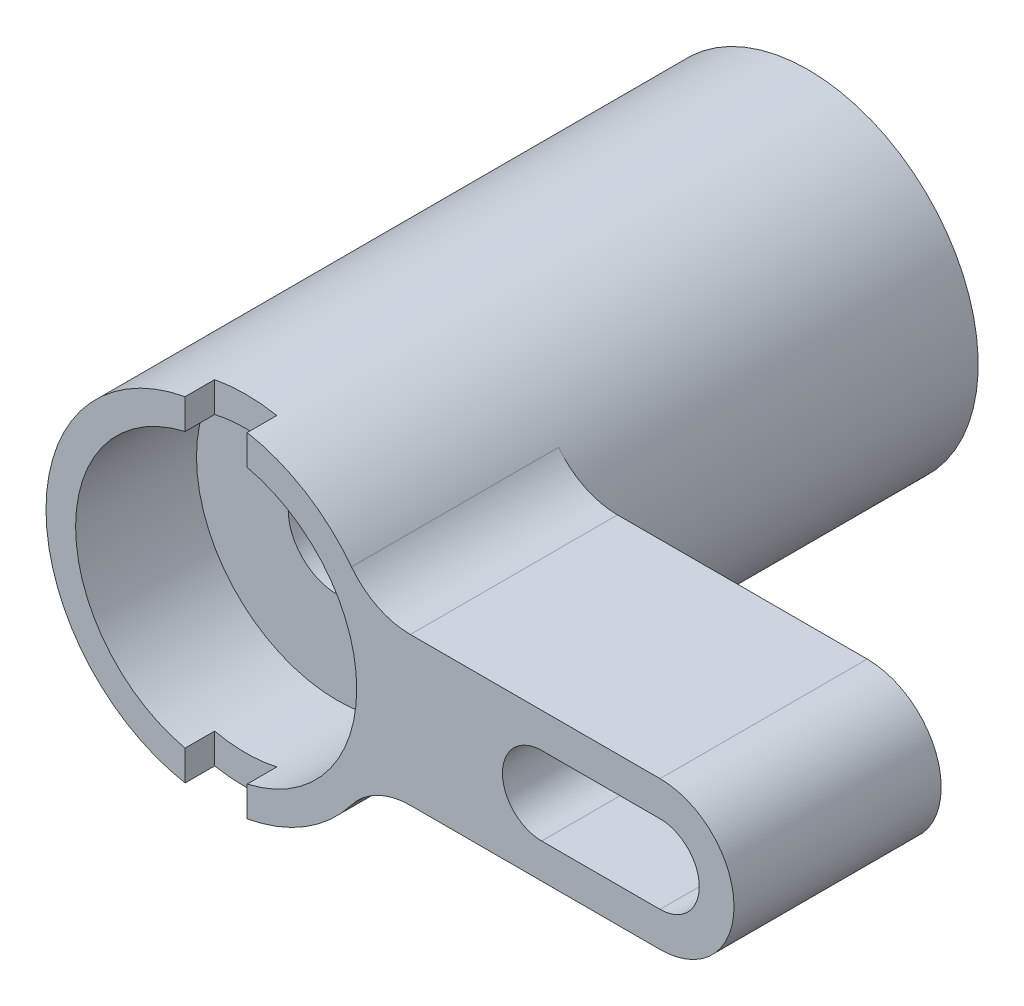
ISO-10303-21;
HEADER;
FILE_DESCRIPTION(('STEP AP214'),'2;1');
FILE_NAME('part.step','',(''),(''),'','','');
FILE_SCHEMA(('AUTOMOTIVE_DESIGN { 1 0 10303 214 1 1 1 1 }'));
ENDSEC;
DATA;
#1=APPLICATION_CONTEXT('core data for automotive mechanical design processes');
#2=APPLICATION_PROTOCOL_DEFINITION('international standard','automotive_design',2000,#1);
#3=PRODUCT_CONTEXT('',#1,'mechanical');
#4=PRODUCT('Part','Part','',(#3));
#5=PRODUCT_RELATED_PRODUCT_CATEGORY('part','',(#4));
#6=PRODUCT_DEFINITION_FORMATION('','',#4);
#7=PRODUCT_DEFINITION_CONTEXT('part definition',#1,'design');
#8=PRODUCT_DEFINITION('design','',#6,#7);
#9=PRODUCT_DEFINITION_SHAPE('','',#8);
#10=(LENGTH_UNIT() NAMED_UNIT(*) SI_UNIT(.MILLI.,.METRE.));
#11=(NAMED_UNIT(*) PLANE_ANGLE_UNIT() SI_UNIT($,.RADIAN.));
#12=(NAMED_UNIT(*) SI_UNIT($,.STERADIAN.) SOLID_ANGLE_UNIT());
#13=UNCERTAINTY_MEASURE_WITH_UNIT(LENGTH_MEASURE(1.E-05),#10,'distance_accuracy_value','');
#14=(GEOMETRIC_REPRESENTATION_CONTEXT(3) GLOBAL_UNCERTAINTY_ASSIGNED_CONTEXT((#13)) GLOBAL_UNIT_ASSIGNED_CONTEXT((#10,
#11,#12)) REPRESENTATION_CONTEXT('',''));
#15=CARTESIAN_POINT('',(0.,0.,0.));
#16=DIRECTION('',(0.,0.,1.));
#17=DIRECTION('',(1.,0.,0.));
#18=AXIS2_PLACEMENT_3D('',#15,#16,#17);
#19=CARTESIAN_POINT('',(0.,0.,26.));
#20=DIRECTION('',(0.,0.,-1.));
#21=DIRECTION('',(0.,-1.,0.));
#22=AXIS2_PLACEMENT_3D('',#19,#20,#21);
#23=PLANE('',#22);
#24=CARTESIAN_POINT('',(0.,0.,26.));
#25=DIRECTION('',(0.,0.,1.));
#26=DIRECTION('',(0.,1.,0.));
#27=AXIS2_PLACEMENT_3D('',#24,#25,#26);
#28=CIRCLE('',#27,3.3);
#29=CARTESIAN_POINT('',(0.,3.3,26.));
#30=VERTEX_POINT('',#29);
#31=EDGE_CURVE('E217',#30,#30,#28,.T.);
#32=ORIENTED_EDGE('',*,*,#31,.T.);
#33=EDGE_LOOP('',(#32));
#34=FACE_BOUND('',#33,.T.);
#35=CARTESIAN_POINT('',(0.,0.,26.));
#36=DIRECTION('',(0.,0.,-1.));
#37=DIRECTION('',(0.,-1.,0.));
#38=AXIS2_PLACEMENT_3D('',#35,#36,#37);
#39=CIRCLE('',#38,3.);
#40=CARTESIAN_POINT('',(0.,-3.,26.));
#41=VERTEX_POINT('',#40);
#42=EDGE_CURVE('E324',#41,#41,#39,.F.);
#43=ORIENTED_EDGE('',*,*,#42,.F.);
#44=EDGE_LOOP('',(#43));
#45=FACE_BOUND('',#44,.T.);
#46=ADVANCED_FACE('F14',(#34,#45),#23,.F.);
#47=CARTESIAN_POINT('',(0.,0.,0.));
#48=DIRECTION('',(0.,0.,1.));
#49=DIRECTION('',(0.,1.,0.));
#50=AXIS2_PLACEMENT_3D('',#47,#48,#49);
#51=PLANE('',#50);
#52=CARTESIAN_POINT('',(0.,0.,0.));
#53=DIRECTION('',(0.,0.,1.));
#54=DIRECTION('',(0.,1.,0.));
#55=AXIS2_PLACEMENT_3D('',#52,#53,#54);
#56=CIRCLE('',#55,8.);
#57=CARTESIAN_POINT('',(0.,8.,0.));
#58=VERTEX_POINT('',#57);
#59=EDGE_CURVE('E18',#58,#58,#56,.T.);
#60=ORIENTED_EDGE('',*,*,#59,.T.);
#61=EDGE_LOOP('',(#60));
#62=FACE_BOUND('',#61,.T.);
#63=CARTESIAN_POINT('',(0.,0.,0.));
#64=DIRECTION('',(0.,0.,1.));
#65=DIRECTION('',(0.,1.,0.));
#66=AXIS2_PLACEMENT_3D('',#63,#64,#65);
#67=CIRCLE('',#66,11.5);
#68=CARTESIAN_POINT('',(0.,11.5,0.));
#69=VERTEX_POINT('',#68);
#70=EDGE_CURVE('E207',#69,#69,#67,.T.);
#71=ORIENTED_EDGE('',*,*,#70,.F.);
#72=EDGE_LOOP('',(#71));
#73=FACE_BOUND('',#72,.T.);
#74=ADVANCED_FACE('F351',(#62,#73),#51,.F.);
#75=CARTESIAN_POINT('',(0.,0.,40.));
#76=DIRECTION('',(0.,0.,1.));
#77=DIRECTION('',(0.,1.,0.));
#78=AXIS2_PLACEMENT_3D('',#75,#76,#77);
#79=PLANE('',#78);
#80=CARTESIAN_POINT('',(0.,0.,40.));
#81=DIRECTION('',(0.,0.,1.));
#82=DIRECTION('',(0.,1.,0.));
#83=AXIS2_PLACEMENT_3D('',#80,#81,#82);
#84=CIRCLE('',#83,9.5);
#85=CARTESIAN_POINT('',(2.1,-9.26498785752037,40.));
#86=VERTEX_POINT('',#85);
#87=CARTESIAN_POINT('',(2.1,9.26498785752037,40.));
#88=VERTEX_POINT('',#87);
#89=EDGE_CURVE('E159',#86,#88,#84,.T.);
#90=ORIENTED_EDGE('',*,*,#89,.F.);
#91=DIRECTION('',(0.,1.,0.));
#92=VECTOR('',#91,1.);
#93=CARTESIAN_POINT('',(2.1,-12.,40.));
#94=LINE('',#93,#92);
#95=CARTESIAN_POINT('',(2.1,-11.3066352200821,40.));
#96=VERTEX_POINT('',#95);
#97=EDGE_CURVE('E168',#96,#86,#94,.T.);
#98=ORIENTED_EDGE('',*,*,#97,.F.);
#99=CARTESIAN_POINT('',(0.,0.,40.));
#100=DIRECTION('',(0.,0.,1.));
#101=DIRECTION('',(0.,1.,0.));
#102=AXIS2_PLACEMENT_3D('',#99,#100,#101);
#103=CIRCLE('',#102,11.5);
#104=CARTESIAN_POINT('',(9.14731240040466,-6.96969696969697,40.));
#105=VERTEX_POINT('',#104);
#106=EDGE_CURVE('E269',#96,#105,#103,.T.);
#107=ORIENTED_EDGE('',*,*,#106,.T.);
#108=CARTESIAN_POINT('',(13.1244047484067,-10.,40.));
#109=DIRECTION('',(0.,0.,1.));
#110=DIRECTION('',(0.,1.,0.));
#111=AXIS2_PLACEMENT_3D('',#108,#109,#110);
#112=CIRCLE('',#111,5.);
#113=CARTESIAN_POINT('',(13.1244047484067,-5.,40.));
#114=VERTEX_POINT('',#113);
#115=EDGE_CURVE('E242',#105,#114,#112,.F.);
#116=ORIENTED_EDGE('',*,*,#115,.T.);
#117=DIRECTION('',(1.,0.,0.));
#118=VECTOR('',#117,1.);
#119=CARTESIAN_POINT('',(30.,-5.,40.));
#120=LINE('',#119,#118);
#121=CARTESIAN_POINT('',(30.,-5.,40.));
#122=VERTEX_POINT('',#121);
#123=EDGE_CURVE('E282',#114,#122,#120,.T.);
#124=ORIENTED_EDGE('',*,*,#123,.T.);
#125=CARTESIAN_POINT('',(30.,0.,40.));
#126=DIRECTION('',(0.,0.,1.));
#127=DIRECTION('',(0.,1.,0.));
#128=AXIS2_PLACEMENT_3D('',#125,#126,#127);
#129=CIRCLE('',#128,5.);
#130=CARTESIAN_POINT('',(30.,5.,40.));
#131=VERTEX_POINT('',#130);
#132=EDGE_CURVE('E227',#122,#131,#129,.T.);
#133=ORIENTED_EDGE('',*,*,#132,.T.);
#134=DIRECTION('',(-1.,0.,0.));
#135=VECTOR('',#134,1.);
#136=CARTESIAN_POINT('',(30.,5.,40.));
#137=LINE('',#136,#135);
#138=CARTESIAN_POINT('',(13.1244047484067,5.,40.));
#139=VERTEX_POINT('',#138);
#140=EDGE_CURVE('E277',#131,#139,#137,.T.);
#141=ORIENTED_EDGE('',*,*,#140,.T.);
#142=CARTESIAN_POINT('',(13.1244047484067,10.,40.));
#143=DIRECTION('',(0.,0.,1.));
#144=DIRECTION('',(0.,1.,0.));
#145=AXIS2_PLACEMENT_3D('',#142,#143,#144);
#146=CIRCLE('',#145,5.);
#147=CARTESIAN_POINT('',(9.14731240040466,6.96969696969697,40.));
#148=VERTEX_POINT('',#147);
#149=EDGE_CURVE('E23',#139,#148,#146,.F.);
#150=ORIENTED_EDGE('',*,*,#149,.T.);
#151=CARTESIAN_POINT('',(2.1,11.3066352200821,40.));
#152=VERTEX_POINT('',#151);
#153=EDGE_CURVE('E279',#148,#152,#103,.T.);
#154=ORIENTED_EDGE('',*,*,#153,.T.);
#155=EDGE_CURVE('E170',#88,#152,#94,.T.);
#156=ORIENTED_EDGE('',*,*,#155,.F.);
#157=EDGE_LOOP('',(#90,#98,#107,#116,#124,#133,#141,#150,#154,#156));
#158=FACE_BOUND('',#157,.T.);
#159=CARTESIAN_POINT('',(30.,0.,40.));
#160=DIRECTION('',(0.,0.,1.));
#161=DIRECTION('',(0.,1.,0.));
#162=AXIS2_PLACEMENT_3D('',#159,#160,#161);
#163=CIRCLE('',#162,2.65);
#164=CARTESIAN_POINT('',(30.,-2.65,40.));
#165=VERTEX_POINT('',#164);
#166=CARTESIAN_POINT('',(30.,2.65,40.));
#167=VERTEX_POINT('',#166);
#168=EDGE_CURVE('E183',#165,#167,#163,.T.);
#169=ORIENTED_EDGE('',*,*,#168,.F.);
#170=DIRECTION('',(1.,0.,0.));
#171=VECTOR('',#170,1.);
#172=CARTESIAN_POINT('',(30.,-2.65,40.));
#173=LINE('',#172,#171);
#174=CARTESIAN_POINT('',(22.,-2.65,40.));
#175=VERTEX_POINT('',#174);
#176=EDGE_CURVE('E191',#175,#165,#173,.T.);
#177=ORIENTED_EDGE('',*,*,#176,.F.);
#178=CARTESIAN_POINT('',(22.,0.,40.));
#179=DIRECTION('',(0.,0.,1.));
#180=DIRECTION('',(0.,1.,0.));
#181=AXIS2_PLACEMENT_3D('',#178,#179,#180);
#182=CIRCLE('',#181,2.65);
#183=CARTESIAN_POINT('',(22.,2.65,40.));
#184=VERTEX_POINT('',#183);
#185=EDGE_CURVE('E188',#184,#175,#182,.T.);
#186=ORIENTED_EDGE('',*,*,#185,.F.);
#187=DIRECTION('',(-1.,0.,0.));
#188=VECTOR('',#187,1.);
#189=CARTESIAN_POINT('',(30.,2.65,40.));
#190=LINE('',#189,#188);
#191=EDGE_CURVE('E185',#167,#184,#190,.T.);
#192=ORIENTED_EDGE('',*,*,#191,.F.);
#193=EDGE_LOOP('',(#169,#177,#186,#192));
#194=FACE_BOUND('',#193,.T.);
#195=ADVANCED_FACE('F267',(#158,#194),#79,.T.);
#196=CARTESIAN_POINT('',(-2.1,9.26498785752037,40.));
#197=VERTEX_POINT('',#196);
#198=CARTESIAN_POINT('',(-2.1,-9.26498785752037,40.));
#199=VERTEX_POINT('',#198);
#200=EDGE_CURVE('E142',#197,#199,#84,.T.);
#201=ORIENTED_EDGE('',*,*,#200,.F.);
#202=DIRECTION('',(0.,-1.,0.));
#203=VECTOR('',#202,1.);
#204=CARTESIAN_POINT('',(-2.1,-12.,40.));
#205=LINE('',#204,#203);
#206=CARTESIAN_POINT('',(-2.1,11.3066352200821,40.));
#207=VERTEX_POINT('',#206);
#208=EDGE_CURVE('E155',#207,#197,#205,.T.);
#209=ORIENTED_EDGE('',*,*,#208,.F.);
#210=CARTESIAN_POINT('',(-2.1,-11.3066352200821,40.));
#211=VERTEX_POINT('',#210);
#212=EDGE_CURVE('E276',#207,#211,#103,.T.);
#213=ORIENTED_EDGE('',*,*,#212,.T.);
#214=EDGE_CURVE('E157',#199,#211,#205,.T.);
#215=ORIENTED_EDGE('',*,*,#214,.F.);
#216=EDGE_LOOP('',(#201,#209,#213,#215));
#217=FACE_BOUND('',#216,.T.);
#218=ADVANCED_FACE('F16',(#217),#79,.T.);
#219=CARTESIAN_POINT('',(0.,0.,26.));
#220=DIRECTION('',(0.,0.,1.));
#221=DIRECTION('',(0.,1.,0.));
#222=AXIS2_PLACEMENT_3D('',#219,#220,#221);
#223=PLANE('',#222);
#224=DIRECTION('',(-1.,0.,0.));
#225=VECTOR('',#224,1.);
#226=CARTESIAN_POINT('',(30.,-2.65,26.));
#227=LINE('',#226,#225);
#228=CARTESIAN_POINT('',(30.,-2.65,26.));
#229=VERTEX_POINT('',#228);
#230=CARTESIAN_POINT('',(22.,-2.65,26.));
#231=VERTEX_POINT('',#230);
#232=EDGE_CURVE('E177',#229,#231,#227,.T.);
#233=ORIENTED_EDGE('',*,*,#232,.F.);
#234=CARTESIAN_POINT('',(30.,0.,26.));
#235=DIRECTION('',(0.,0.,1.));
#236=DIRECTION('',(0.,1.,0.));
#237=AXIS2_PLACEMENT_3D('',#234,#235,#236);
#238=CIRCLE('',#237,2.65);
#239=CARTESIAN_POINT('',(30.,2.65,26.));
#240=VERTEX_POINT('',#239);
#241=EDGE_CURVE('E180',#240,#229,#238,.F.);
#242=ORIENTED_EDGE('',*,*,#241,.F.);
#243=DIRECTION('',(1.,0.,0.));
#244=VECTOR('',#243,1.);
#245=CARTESIAN_POINT('',(30.,2.65,26.));
#246=LINE('',#245,#244);
#247=CARTESIAN_POINT('',(22.,2.65,26.));
#248=VERTEX_POINT('',#247);
#249=EDGE_CURVE('E197',#248,#240,#246,.T.);
#250=ORIENTED_EDGE('',*,*,#249,.F.);
#251=CARTESIAN_POINT('',(22.,0.,26.));
#252=DIRECTION('',(0.,0.,1.));
#253=DIRECTION('',(0.,1.,0.));
#254=AXIS2_PLACEMENT_3D('',#251,#252,#253);
#255=CIRCLE('',#254,2.65);
#256=EDGE_CURVE('E175',#231,#248,#255,.F.);
#257=ORIENTED_EDGE('',*,*,#256,.F.);
#258=EDGE_LOOP('',(#233,#242,#250,#257));
#259=FACE_BOUND('',#258,.T.);
#260=DIRECTION('',(1.,0.,0.));
#261=VECTOR('',#260,1.);
#262=CARTESIAN_POINT('',(30.,-5.,26.));
#263=LINE('',#262,#261);
#264=CARTESIAN_POINT('',(13.1244047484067,-5.,26.));
#265=VERTEX_POINT('',#264);
#266=CARTESIAN_POINT('',(30.,-5.,26.));
#267=VERTEX_POINT('',#266);
#268=EDGE_CURVE('E224',#265,#267,#263,.T.);
#269=ORIENTED_EDGE('',*,*,#268,.F.);
#270=CARTESIAN_POINT('',(13.1244047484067,-10.,26.));
#271=DIRECTION('',(0.,0.,1.));
#272=DIRECTION('',(0.,1.,0.));
#273=AXIS2_PLACEMENT_3D('',#270,#271,#272);
#274=CIRCLE('',#273,5.);
#275=CARTESIAN_POINT('',(9.14731240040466,-6.96969696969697,26.));
#276=VERTEX_POINT('',#275);
#277=EDGE_CURVE('E239',#265,#276,#274,.T.);
#278=ORIENTED_EDGE('',*,*,#277,.T.);
#279=CARTESIAN_POINT('',(0.,0.,26.));
#280=DIRECTION('',(0.,0.,1.));
#281=DIRECTION('',(0.,1.,0.));
#282=AXIS2_PLACEMENT_3D('',#279,#280,#281);
#283=CIRCLE('',#282,11.5);
#284=CARTESIAN_POINT('',(9.14731240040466,6.96969696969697,26.));
#285=VERTEX_POINT('',#284);
#286=EDGE_CURVE('E206',#276,#285,#283,.T.);
#287=ORIENTED_EDGE('',*,*,#286,.T.);
#288=CARTESIAN_POINT('',(13.1244047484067,10.,26.));
#289=DIRECTION('',(0.,0.,1.));
#290=DIRECTION('',(0.,1.,0.));
#291=AXIS2_PLACEMENT_3D('',#288,#289,#290);
#292=CIRCLE('',#291,5.);
#293=CARTESIAN_POINT('',(13.1244047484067,5.,26.));
#294=VERTEX_POINT('',#293);
#295=EDGE_CURVE('E244',#285,#294,#292,.T.);
#296=ORIENTED_EDGE('',*,*,#295,.T.);
#297=DIRECTION('',(-1.,0.,0.));
#298=VECTOR('',#297,1.);
#299=CARTESIAN_POINT('',(30.,5.,26.));
#300=LINE('',#299,#298);
#301=CARTESIAN_POINT('',(30.,5.,26.));
#302=VERTEX_POINT('',#301);
#303=EDGE_CURVE('E221',#302,#294,#300,.T.);
#304=ORIENTED_EDGE('',*,*,#303,.F.);
#305=CARTESIAN_POINT('',(30.,0.,26.));
#306=DIRECTION('',(0.,0.,1.));
#307=DIRECTION('',(0.,1.,0.));
#308=AXIS2_PLACEMENT_3D('',#305,#306,#307);
#309=CIRCLE('',#308,5.);
#310=EDGE_CURVE('E210',#267,#302,#309,.T.);
#311=ORIENTED_EDGE('',*,*,#310,.F.);
#312=EDGE_LOOP('',(#269,#278,#287,#296,#304,#311));
#313=FACE_BOUND('',#312,.T.);
#314=ADVANCED_FACE('F376',(#259,#313),#223,.F.);
#315=CARTESIAN_POINT('',(30.,0.,40.));
#316=DIRECTION('',(0.,0.,-1.));
#317=DIRECTION('',(0.,-1.,0.));
#318=AXIS2_PLACEMENT_3D('',#315,#316,#317);
#319=CYLINDRICAL_SURFACE('',#318,5.);
#320=ORIENTED_EDGE('',*,*,#310,.T.);
#321=DIRECTION('',(0.,0.,-1.));
#322=VECTOR('',#321,1.);
#323=CARTESIAN_POINT('',(30.,5.,40.));
#324=LINE('',#323,#322);
#325=EDGE_CURVE('E290',#131,#302,#324,.T.);
#326=ORIENTED_EDGE('',*,*,#325,.F.);
#327=ORIENTED_EDGE('',*,*,#132,.F.);
#328=DIRECTION('',(0.,0.,-1.));
#329=VECTOR('',#328,1.);
#330=CARTESIAN_POINT('',(30.,-5.,40.));
#331=LINE('',#330,#329);
#332=EDGE_CURVE('E285',#122,#267,#331,.T.);
#333=ORIENTED_EDGE('',*,*,#332,.T.);
#334=EDGE_LOOP('',(#320,#326,#327,#333));
#335=FACE_BOUND('',#334,.T.);
#336=ADVANCED_FACE('F373',(#335),#319,.T.);
#337=CARTESIAN_POINT('',(30.,5.,40.));
#338=DIRECTION('',(0.,-1.,0.));
#339=DIRECTION('',(1.,0.,0.));
#340=AXIS2_PLACEMENT_3D('',#337,#338,#339);
#341=PLANE('',#340);
#342=ORIENTED_EDGE('',*,*,#303,.T.);
#343=DIRECTION('',(0.,0.,1.));
#344=VECTOR('',#343,1.);
#345=CARTESIAN_POINT('',(13.1244047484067,5.,40.));
#346=LINE('',#345,#344);
#347=EDGE_CURVE('E38',#294,#139,#346,.T.);
#348=ORIENTED_EDGE('',*,*,#347,.T.);
#349=ORIENTED_EDGE('',*,*,#140,.F.);
#350=ORIENTED_EDGE('',*,*,#325,.T.);
#351=EDGE_LOOP('',(#342,#348,#349,#350));
#352=FACE_BOUND('',#351,.T.);
#353=ADVANCED_FACE('F370',(#352),#341,.F.);
#354=CARTESIAN_POINT('',(0.,0.,40.));
#355=DIRECTION('',(0.,0.,-1.));
#356=DIRECTION('',(0.,-1.,0.));
#357=AXIS2_PLACEMENT_3D('',#354,#355,#356);
#358=CYLINDRICAL_SURFACE('',#357,11.5);
#359=ORIENTED_EDGE('',*,*,#286,.F.);
#360=DIRECTION('',(0.,0.,-1.));
#361=VECTOR('',#360,1.);
#362=CARTESIAN_POINT('',(9.14731240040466,-6.96969696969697,40.));
#363=LINE('',#362,#361);
#364=EDGE_CURVE('E236',#276,#105,#363,.F.);
#365=ORIENTED_EDGE('',*,*,#364,.T.);
#366=ORIENTED_EDGE('',*,*,#106,.F.);
#367=DIRECTION('',(0.,0.,-1.));
#368=VECTOR('',#367,1.);
#369=CARTESIAN_POINT('',(2.1,-11.3066352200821,40.));
#370=LINE('',#369,#368);
#371=CARTESIAN_POINT('',(2.1,-11.3066352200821,38.));
#372=VERTEX_POINT('',#371);
#373=EDGE_CURVE('E228',#96,#372,#370,.T.);
#374=ORIENTED_EDGE('',*,*,#373,.T.);
#375=CARTESIAN_POINT('',(0.,0.,38.));
#376=DIRECTION('',(0.,0.,1.));
#377=DIRECTION('',(0.,1.,0.));
#378=AXIS2_PLACEMENT_3D('',#375,#376,#377);
#379=CIRCLE('',#378,11.5);
#380=CARTESIAN_POINT('',(-2.1,-11.3066352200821,38.));
#381=VERTEX_POINT('',#380);
#382=EDGE_CURVE('E300',#381,#372,#379,.T.);
#383=ORIENTED_EDGE('',*,*,#382,.F.);
#384=DIRECTION('',(0.,0.,-1.));
#385=VECTOR('',#384,1.);
#386=CARTESIAN_POINT('',(-2.1,-11.3066352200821,40.));
#387=LINE('',#386,#385);
#388=EDGE_CURVE('E305',#381,#211,#387,.F.);
#389=ORIENTED_EDGE('',*,*,#388,.T.);
#390=ORIENTED_EDGE('',*,*,#212,.F.);
#391=DIRECTION('',(0.,0.,-1.));
#392=VECTOR('',#391,1.);
#393=CARTESIAN_POINT('',(-2.1,11.3066352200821,40.));
#394=LINE('',#393,#392);
#395=CARTESIAN_POINT('',(-2.1,11.3066352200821,38.));
#396=VERTEX_POINT('',#395);
#397=EDGE_CURVE('E163',#207,#396,#394,.T.);
#398=ORIENTED_EDGE('',*,*,#397,.T.);
#399=CARTESIAN_POINT('',(2.1,11.3066352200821,38.));
#400=VERTEX_POINT('',#399);
#401=EDGE_CURVE('E296',#400,#396,#379,.T.);
#402=ORIENTED_EDGE('',*,*,#401,.F.);
#403=DIRECTION('',(0.,0.,-1.));
#404=VECTOR('',#403,1.);
#405=CARTESIAN_POINT('',(2.1,11.3066352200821,40.));
#406=LINE('',#405,#404);
#407=EDGE_CURVE('E303',#400,#152,#406,.F.);
#408=ORIENTED_EDGE('',*,*,#407,.T.);
#409=ORIENTED_EDGE('',*,*,#153,.F.);
#410=DIRECTION('',(0.,0.,-1.));
#411=VECTOR('',#410,1.);
#412=CARTESIAN_POINT('',(9.14731240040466,6.96969696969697,40.));
#413=LINE('',#412,#411);
#414=EDGE_CURVE('E233',#148,#285,#413,.T.);
#415=ORIENTED_EDGE('',*,*,#414,.T.);
#416=EDGE_LOOP('',(#359,#365,#366,#374,#383,#389,#390,#398,#402,#408,#409,#415));
#417=FACE_BOUND('',#416,.T.);
#418=ORIENTED_EDGE('',*,*,#70,.T.);
#419=EDGE_LOOP('',(#418));
#420=FACE_BOUND('',#419,.T.);
#421=ADVANCED_FACE('F272',(#417,#420),#358,.T.);
#422=CARTESIAN_POINT('',(30.,-5.,40.));
#423=DIRECTION('',(0.,1.,0.));
#424=DIRECTION('',(-1.,0.,0.));
#425=AXIS2_PLACEMENT_3D('',#422,#423,#424);
#426=PLANE('',#425);
#427=ORIENTED_EDGE('',*,*,#123,.F.);
#428=DIRECTION('',(0.,0.,1.));
#429=VECTOR('',#428,1.);
#430=CARTESIAN_POINT('',(13.1244047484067,-5.,26.));
#431=LINE('',#430,#429);
#432=EDGE_CURVE('E230',#114,#265,#431,.F.);
#433=ORIENTED_EDGE('',*,*,#432,.T.);
#434=ORIENTED_EDGE('',*,*,#268,.T.);
#435=ORIENTED_EDGE('',*,*,#332,.F.);
#436=EDGE_LOOP('',(#427,#433,#434,#435));
#437=FACE_BOUND('',#436,.T.);
#438=ADVANCED_FACE('F364',(#437),#426,.F.);
#439=CARTESIAN_POINT('',(30.,0.,-0.001000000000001));
#440=DIRECTION('',(0.,0.,1.));
#441=DIRECTION('',(0.,1.,0.));
#442=AXIS2_PLACEMENT_3D('',#439,#440,#441);
#443=CYLINDRICAL_SURFACE('',#442,2.65);
#444=ORIENTED_EDGE('',*,*,#241,.T.);
#445=DIRECTION('',(0.,0.,1.));
#446=VECTOR('',#445,1.);
#447=CARTESIAN_POINT('',(30.,-2.65,-0.001000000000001));
#448=LINE('',#447,#446);
#449=EDGE_CURVE('E195',#229,#165,#448,.T.);
#450=ORIENTED_EDGE('',*,*,#449,.T.);
#451=ORIENTED_EDGE('',*,*,#168,.T.);
#452=DIRECTION('',(0.,0.,1.));
#453=VECTOR('',#452,1.);
#454=CARTESIAN_POINT('',(30.,2.65,-0.001000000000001));
#455=LINE('',#454,#453);
#456=EDGE_CURVE('E194',#240,#167,#455,.T.);
#457=ORIENTED_EDGE('',*,*,#456,.F.);
#458=EDGE_LOOP('',(#444,#450,#451,#457));
#459=FACE_BOUND('',#458,.T.);
#460=ADVANCED_FACE('F361',(#459),#443,.F.);
#461=CARTESIAN_POINT('',(30.,-2.65,-0.001000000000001));
#462=DIRECTION('',(0.,-1.,0.));
#463=DIRECTION('',(1.,0.,0.));
#464=AXIS2_PLACEMENT_3D('',#461,#462,#463);
#465=PLANE('',#464);
#466=ORIENTED_EDGE('',*,*,#232,.T.);
#467=DIRECTION('',(0.,0.,1.));
#468=VECTOR('',#467,1.);
#469=CARTESIAN_POINT('',(22.,-2.65,-0.001000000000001));
#470=LINE('',#469,#468);
#471=EDGE_CURVE('E198',#231,#175,#470,.T.);
#472=ORIENTED_EDGE('',*,*,#471,.T.);
#473=ORIENTED_EDGE('',*,*,#176,.T.);
#474=ORIENTED_EDGE('',*,*,#449,.F.);
#475=EDGE_LOOP('',(#466,#472,#473,#474));
#476=FACE_BOUND('',#475,.T.);
#477=ADVANCED_FACE('F420',(#476),#465,.F.);
#478=CARTESIAN_POINT('',(22.,0.,-0.001000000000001));
#479=DIRECTION('',(0.,0.,1.));
#480=DIRECTION('',(0.,1.,0.));
#481=AXIS2_PLACEMENT_3D('',#478,#479,#480);
#482=CYLINDRICAL_SURFACE('',#481,2.65);
#483=ORIENTED_EDGE('',*,*,#256,.T.);
#484=DIRECTION('',(0.,0.,1.));
#485=VECTOR('',#484,1.);
#486=CARTESIAN_POINT('',(22.,2.65,-0.001000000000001));
#487=LINE('',#486,#485);
#488=EDGE_CURVE('E200',#248,#184,#487,.T.);
#489=ORIENTED_EDGE('',*,*,#488,.T.);
#490=ORIENTED_EDGE('',*,*,#185,.T.);
#491=ORIENTED_EDGE('',*,*,#471,.F.);
#492=EDGE_LOOP('',(#483,#489,#490,#491));
#493=FACE_BOUND('',#492,.T.);
#494=ADVANCED_FACE('F423',(#493),#482,.F.);
#495=CARTESIAN_POINT('',(30.,2.65,-0.001000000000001));
#496=DIRECTION('',(0.,1.,0.));
#497=DIRECTION('',(-1.,0.,0.));
#498=AXIS2_PLACEMENT_3D('',#495,#496,#497);
#499=PLANE('',#498);
#500=ORIENTED_EDGE('',*,*,#249,.T.);
#501=ORIENTED_EDGE('',*,*,#456,.T.);
#502=ORIENTED_EDGE('',*,*,#191,.T.);
#503=ORIENTED_EDGE('',*,*,#488,.F.);
#504=EDGE_LOOP('',(#500,#501,#502,#503));
#505=FACE_BOUND('',#504,.T.);
#506=ADVANCED_FACE('F426',(#505),#499,.F.);
#507=CARTESIAN_POINT('',(2.1,12.,38.));
#508=DIRECTION('',(0.,0.,1.));
#509=DIRECTION('',(0.,1.,0.));
#510=AXIS2_PLACEMENT_3D('',#507,#508,#509);
#511=PLANE('',#510);
#512=CARTESIAN_POINT('',(0.,0.,38.));
#513=DIRECTION('',(0.,0.,1.));
#514=DIRECTION('',(0.,1.,0.));
#515=AXIS2_PLACEMENT_3D('',#512,#513,#514);
#516=CIRCLE('',#515,9.5);
#517=CARTESIAN_POINT('',(2.1,9.26498785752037,38.));
#518=VERTEX_POINT('',#517);
#519=CARTESIAN_POINT('',(-2.1,9.26498785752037,38.));
#520=VERTEX_POINT('',#519);
#521=EDGE_CURVE('E144',#518,#520,#516,.T.);
#522=ORIENTED_EDGE('',*,*,#521,.F.);
#523=DIRECTION('',(0.,1.,0.));
#524=VECTOR('',#523,1.);
#525=CARTESIAN_POINT('',(2.1,-12.,38.));
#526=LINE('',#525,#524);
#527=EDGE_CURVE('E164',#518,#400,#526,.T.);
#528=ORIENTED_EDGE('',*,*,#527,.T.);
#529=ORIENTED_EDGE('',*,*,#401,.T.);
#530=DIRECTION('',(0.,-1.,0.));
#531=VECTOR('',#530,1.);
#532=CARTESIAN_POINT('',(-2.1,-12.,38.));
#533=LINE('',#532,#531);
#534=EDGE_CURVE('E174',#396,#520,#533,.T.);
#535=ORIENTED_EDGE('',*,*,#534,.T.);
#536=EDGE_LOOP('',(#522,#528,#529,#535));
#537=FACE_BOUND('',#536,.T.);
#538=ADVANCED_FACE('F313',(#537),#511,.T.);
#539=CARTESIAN_POINT('',(-2.1,-12.,38.));
#540=DIRECTION('',(-1.,0.,0.));
#541=DIRECTION('',(0.,-1.,0.));
#542=AXIS2_PLACEMENT_3D('',#539,#540,#541);
#543=PLANE('',#542);
#544=ORIENTED_EDGE('',*,*,#208,.T.);
#545=DIRECTION('',(0.,0.,1.));
#546=VECTOR('',#545,1.);
#547=CARTESIAN_POINT('',(-2.1,9.26498785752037,31.83));
#548=LINE('',#547,#546);
#549=EDGE_CURVE('E139',#197,#520,#548,.F.);
#550=ORIENTED_EDGE('',*,*,#549,.T.);
#551=ORIENTED_EDGE('',*,*,#534,.F.);
#552=ORIENTED_EDGE('',*,*,#397,.F.);
#553=EDGE_LOOP('',(#544,#550,#551,#552));
#554=FACE_BOUND('',#553,.T.);
#555=ADVANCED_FACE('F161',(#554),#543,.F.);
#556=CARTESIAN_POINT('',(2.1,-12.,38.));
#557=DIRECTION('',(1.,0.,0.));
#558=DIRECTION('',(0.,1.,0.));
#559=AXIS2_PLACEMENT_3D('',#556,#557,#558);
#560=PLANE('',#559);
#561=ORIENTED_EDGE('',*,*,#527,.F.);
#562=DIRECTION('',(0.,0.,1.));
#563=VECTOR('',#562,1.);
#564=CARTESIAN_POINT('',(2.1,9.26498785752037,31.83));
#565=LINE('',#564,#563);
#566=EDGE_CURVE('E312',#518,#88,#565,.T.);
#567=ORIENTED_EDGE('',*,*,#566,.T.);
#568=ORIENTED_EDGE('',*,*,#155,.T.);
#569=ORIENTED_EDGE('',*,*,#407,.F.);
#570=EDGE_LOOP('',(#561,#567,#568,#569));
#571=FACE_BOUND('',#570,.T.);
#572=ADVANCED_FACE('F311',(#571),#560,.F.);
#573=ORIENTED_EDGE('',*,*,#97,.T.);
#574=DIRECTION('',(0.,0.,1.));
#575=VECTOR('',#574,1.);
#576=CARTESIAN_POINT('',(2.1,-9.26498785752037,31.83));
#577=LINE('',#576,#575);
#578=CARTESIAN_POINT('',(2.1,-9.26498785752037,38.));
#579=VERTEX_POINT('',#578);
#580=EDGE_CURVE('E260',#86,#579,#577,.F.);
#581=ORIENTED_EDGE('',*,*,#580,.T.);
#582=EDGE_CURVE('E166',#372,#579,#526,.T.);
#583=ORIENTED_EDGE('',*,*,#582,.F.);
#584=ORIENTED_EDGE('',*,*,#373,.F.);
#585=EDGE_LOOP('',(#573,#581,#583,#584));
#586=FACE_BOUND('',#585,.T.);
#587=ADVANCED_FACE('F258',(#586),#560,.F.);
#588=CARTESIAN_POINT('',(-2.1,-9.26498785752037,38.));
#589=VERTEX_POINT('',#588);
#590=EDGE_CURVE('E172',#589,#381,#533,.T.);
#591=ORIENTED_EDGE('',*,*,#590,.F.);
#592=DIRECTION('',(0.,0.,1.));
#593=VECTOR('',#592,1.);
#594=CARTESIAN_POINT('',(-2.1,-9.26498785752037,31.83));
#595=LINE('',#594,#593);
#596=EDGE_CURVE('E30',#589,#199,#595,.T.);
#597=ORIENTED_EDGE('',*,*,#596,.T.);
#598=ORIENTED_EDGE('',*,*,#214,.T.);
#599=ORIENTED_EDGE('',*,*,#388,.F.);
#600=EDGE_LOOP('',(#591,#597,#598,#599));
#601=FACE_BOUND('',#600,.T.);
#602=ADVANCED_FACE('F415',(#601),#543,.F.);
#603=CARTESIAN_POINT('',(0.,0.,38.));
#604=DIRECTION('',(0.,0.,1.));
#605=DIRECTION('',(0.,1.,0.));
#606=AXIS2_PLACEMENT_3D('',#603,#604,#605);
#607=CIRCLE('',#606,9.5);
#608=EDGE_CURVE('E9',#589,#579,#607,.T.);
#609=ORIENTED_EDGE('',*,*,#608,.F.);
#610=ORIENTED_EDGE('',*,*,#590,.T.);
#611=ORIENTED_EDGE('',*,*,#382,.T.);
#612=ORIENTED_EDGE('',*,*,#582,.T.);
#613=EDGE_LOOP('',(#609,#610,#611,#612));
#614=FACE_BOUND('',#613,.T.);
#615=ADVANCED_FACE('F409',(#614),#511,.T.);
#616=CARTESIAN_POINT('',(13.1244047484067,-10.,40.));
#617=DIRECTION('',(0.,0.,-1.));
#618=DIRECTION('',(0.,-1.,0.));
#619=AXIS2_PLACEMENT_3D('',#616,#617,#618);
#620=CYLINDRICAL_SURFACE('',#619,5.);
#621=ORIENTED_EDGE('',*,*,#115,.F.);
#622=ORIENTED_EDGE('',*,*,#364,.F.);
#623=ORIENTED_EDGE('',*,*,#277,.F.);
#624=ORIENTED_EDGE('',*,*,#432,.F.);
#625=EDGE_LOOP('',(#621,#622,#623,#624));
#626=FACE_BOUND('',#625,.T.);
#627=ADVANCED_FACE('F400',(#626),#620,.F.);
#628=CARTESIAN_POINT('',(13.1244047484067,10.,40.));
#629=DIRECTION('',(0.,0.,-1.));
#630=DIRECTION('',(0.,-1.,0.));
#631=AXIS2_PLACEMENT_3D('',#628,#629,#630);
#632=CYLINDRICAL_SURFACE('',#631,5.);
#633=ORIENTED_EDGE('',*,*,#149,.F.);
#634=ORIENTED_EDGE('',*,*,#347,.F.);
#635=ORIENTED_EDGE('',*,*,#295,.F.);
#636=ORIENTED_EDGE('',*,*,#414,.F.);
#637=EDGE_LOOP('',(#633,#634,#635,#636));
#638=FACE_BOUND('',#637,.T.);
#639=ADVANCED_FACE('F397',(#638),#632,.F.);
#640=CARTESIAN_POINT('',(0.,0.,31.83));
#641=DIRECTION('',(0.,0.,1.));
#642=DIRECTION('',(0.,1.,0.));
#643=AXIS2_PLACEMENT_3D('',#640,#641,#642);
#644=CYLINDRICAL_SURFACE('',#643,9.5);
#645=CARTESIAN_POINT('',(0.,0.,31.83));
#646=DIRECTION('',(0.,0.,1.));
#647=DIRECTION('',(0.,1.,0.));
#648=AXIS2_PLACEMENT_3D('',#645,#646,#647);
#649=CIRCLE('',#648,9.5);
#650=CARTESIAN_POINT('',(0.,9.5,31.83));
#651=VERTEX_POINT('',#650);
#652=EDGE_CURVE('E158',#651,#651,#649,.T.);
#653=ORIENTED_EDGE('',*,*,#652,.F.);
#654=EDGE_LOOP('',(#653));
#655=FACE_BOUND('',#654,.T.);
#656=ORIENTED_EDGE('',*,*,#200,.T.);
#657=ORIENTED_EDGE('',*,*,#596,.F.);
#658=ORIENTED_EDGE('',*,*,#608,.T.);
#659=ORIENTED_EDGE('',*,*,#580,.F.);
#660=ORIENTED_EDGE('',*,*,#89,.T.);
#661=ORIENTED_EDGE('',*,*,#566,.F.);
#662=ORIENTED_EDGE('',*,*,#521,.T.);
#663=ORIENTED_EDGE('',*,*,#549,.F.);
#664=EDGE_LOOP('',(#656,#657,#658,#659,#660,#661,#662,#663));
#665=FACE_BOUND('',#664,.T.);
#666=ADVANCED_FACE('F141',(#655,#665),#644,.F.);
#667=CARTESIAN_POINT('',(0.,0.,31.83));
#668=DIRECTION('',(0.,0.,1.));
#669=DIRECTION('',(0.,1.,0.));
#670=AXIS2_PLACEMENT_3D('',#667,#668,#669);
#671=PLANE('',#670);
#672=CARTESIAN_POINT('',(0.,0.,31.83));
#673=DIRECTION('',(0.,0.,1.));
#674=DIRECTION('',(0.,1.,0.));
#675=AXIS2_PLACEMENT_3D('',#672,#673,#674);
#676=CIRCLE('',#675,3.3);
#677=CARTESIAN_POINT('',(0.,3.3,31.83));
#678=VERTEX_POINT('',#677);
#679=EDGE_CURVE('E149',#678,#678,#676,.T.);
#680=ORIENTED_EDGE('',*,*,#679,.F.);
#681=EDGE_LOOP('',(#680));
#682=FACE_BOUND('',#681,.T.);
#683=ORIENTED_EDGE('',*,*,#652,.T.);
#684=EDGE_LOOP('',(#683));
#685=FACE_BOUND('',#684,.T.);
#686=ADVANCED_FACE('F379',(#682,#685),#671,.T.);
#687=CARTESIAN_POINT('',(0.,0.,40.));
#688=DIRECTION('',(0.,0.,-1.));
#689=DIRECTION('',(0.,-1.,0.));
#690=AXIS2_PLACEMENT_3D('',#687,#688,#689);
#691=CYLINDRICAL_SURFACE('',#690,3.3);
#692=ORIENTED_EDGE('',*,*,#31,.F.);
#693=EDGE_LOOP('',(#692));
#694=FACE_BOUND('',#693,.T.);
#695=ORIENTED_EDGE('',*,*,#679,.T.);
#696=EDGE_LOOP('',(#695));
#697=FACE_BOUND('',#696,.T.);
#698=ADVANCED_FACE('F346',(#694,#697),#691,.F.);
#699=CARTESIAN_POINT('',(0.,0.,-14.));
#700=DIRECTION('',(0.,0.,-1.));
#701=DIRECTION('',(0.,-1.,0.));
#702=AXIS2_PLACEMENT_3D('',#699,#700,#701);
#703=CYLINDRICAL_SURFACE('',#702,8.);
#704=CARTESIAN_POINT('',(0.,0.,24.));
#705=DIRECTION('',(0.,0.,-1.));
#706=DIRECTION('',(0.,-1.,0.));
#707=AXIS2_PLACEMENT_3D('',#704,#705,#706);
#708=CIRCLE('',#707,8.);
#709=CARTESIAN_POINT('',(0.,-8.,24.));
#710=VERTEX_POINT('',#709);
#711=EDGE_CURVE('E321',#710,#710,#708,.T.);
#712=ORIENTED_EDGE('',*,*,#711,.F.);
#713=EDGE_LOOP('',(#712));
#714=FACE_BOUND('',#713,.T.);
#715=ORIENTED_EDGE('',*,*,#59,.F.);
#716=EDGE_LOOP('',(#715));
#717=FACE_BOUND('',#716,.T.);
#718=ADVANCED_FACE('F336',(#714,#717),#703,.F.);
#719=CARTESIAN_POINT('',(-8.,0.,24.));
#720=DIRECTION('',(0.,0.,1.));
#721=DIRECTION('',(0.,1.,0.));
#722=AXIS2_PLACEMENT_3D('',#719,#720,#721);
#723=PLANE('',#722);
#724=ORIENTED_EDGE('',*,*,#711,.T.);
#725=EDGE_LOOP('',(#724));
#726=FACE_BOUND('',#725,.T.);
#727=CARTESIAN_POINT('',(0.,0.,24.));
#728=DIRECTION('',(0.,0.,1.));
#729=DIRECTION('',(0.,1.,0.));
#730=AXIS2_PLACEMENT_3D('',#727,#728,#729);
#731=CIRCLE('',#730,3.);
#732=CARTESIAN_POINT('',(0.,3.,24.));
#733=VERTEX_POINT('',#732);
#734=EDGE_CURVE('E327',#733,#733,#731,.F.);
#735=ORIENTED_EDGE('',*,*,#734,.F.);
#736=EDGE_LOOP('',(#735));
#737=FACE_BOUND('',#736,.T.);
#738=ADVANCED_FACE('F334',(#726,#737),#723,.F.);
#739=CARTESIAN_POINT('',(0.,0.,46.2365938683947));
#740=DIRECTION('',(0.,0.,1.));
#741=DIRECTION('',(-0.342020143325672,-0.939692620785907,0.));
#742=AXIS2_PLACEMENT_3D('',#739,#740,#741);
#743=CYLINDRICAL_SURFACE('',#742,3.);
#744=ORIENTED_EDGE('',*,*,#734,.T.);
#745=EDGE_LOOP('',(#744));
#746=FACE_BOUND('',#745,.T.);
#747=ORIENTED_EDGE('',*,*,#42,.T.);
#748=EDGE_LOOP('',(#747));
#749=FACE_BOUND('',#748,.T.);
#750=ADVANCED_FACE('F331',(#746,#749),#743,.F.);
#751=CLOSED_SHELL('',(#46,#74,#195,#218,#314,#336,#353,#421,#438,#460,#477,#494,#506,#538,#555,
#572,#587,#602,#615,#627,#639,#666,#686,#698,#718,#738,#750));
#752=MANIFOLD_SOLID_BREP('B1',#751);
#753=ADVANCED_BREP_SHAPE_REPRESENTATION('',(#18,#752),#14);
#754=SHAPE_DEFINITION_REPRESENTATION(#9,#753);
ENDSEC;
END-ISO-10303-21;
